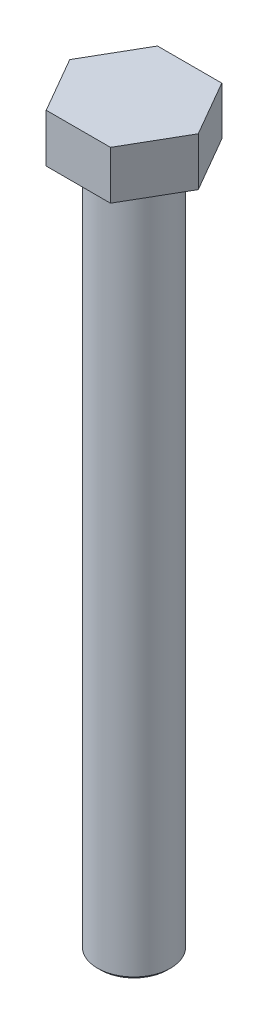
ISO-10303-21;
HEADER;
FILE_DESCRIPTION(('STEP AP214'),'2;1');
FILE_NAME('part.step','',(''),(''),'','','');
FILE_SCHEMA(('AUTOMOTIVE_DESIGN { 1 0 10303 214 1 1 1 1 }'));
ENDSEC;
DATA;
#1=APPLICATION_CONTEXT('core data for automotive mechanical design processes');
#2=APPLICATION_PROTOCOL_DEFINITION('international standard','automotive_design',2000,#1);
#3=PRODUCT_CONTEXT('',#1,'mechanical');
#4=PRODUCT('Part','Part','',(#3));
#5=PRODUCT_RELATED_PRODUCT_CATEGORY('part','',(#4));
#6=PRODUCT_DEFINITION_FORMATION('','',#4);
#7=PRODUCT_DEFINITION_CONTEXT('part definition',#1,'design');
#8=PRODUCT_DEFINITION('design','',#6,#7);
#9=PRODUCT_DEFINITION_SHAPE('','',#8);
#10=(LENGTH_UNIT() NAMED_UNIT(*) SI_UNIT(.MILLI.,.METRE.));
#11=(NAMED_UNIT(*) PLANE_ANGLE_UNIT() SI_UNIT($,.RADIAN.));
#12=(NAMED_UNIT(*) SI_UNIT($,.STERADIAN.) SOLID_ANGLE_UNIT());
#13=UNCERTAINTY_MEASURE_WITH_UNIT(LENGTH_MEASURE(1.E-05),#10,'distance_accuracy_value','');
#14=(GEOMETRIC_REPRESENTATION_CONTEXT(3) GLOBAL_UNCERTAINTY_ASSIGNED_CONTEXT((#13)) GLOBAL_UNIT_ASSIGNED_CONTEXT((#10,
#11,#12)) REPRESENTATION_CONTEXT('',''));
#15=CARTESIAN_POINT('',(0.,0.,0.));
#16=DIRECTION('',(0.,0.,1.));
#17=DIRECTION('',(1.,0.,0.));
#18=AXIS2_PLACEMENT_3D('',#15,#16,#17);
#19=CARTESIAN_POINT('',(8.2635566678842,-6.223,0.));
#20=DIRECTION('',(0.,1.,0.));
#21=DIRECTION('',(0.,0.,1.));
#22=AXIS2_PLACEMENT_3D('',#19,#20,#21);
#23=PLANE('',#22);
#24=DIRECTION('',(0.5,0.,-0.866025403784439));
#25=VECTOR('',#24,1.);
#26=CARTESIAN_POINT('',(4.1317783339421,-6.223,7.15645));
#27=LINE('',#26,#25);
#28=CARTESIAN_POINT('',(4.1317783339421,-6.223,7.15645));
#29=VERTEX_POINT('',#28);
#30=CARTESIAN_POINT('',(8.2635566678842,-6.223,0.));
#31=VERTEX_POINT('',#30);
#32=EDGE_CURVE('E135',#29,#31,#27,.T.);
#33=ORIENTED_EDGE('',*,*,#32,.F.);
#34=DIRECTION('',(1.,0.,0.));
#35=VECTOR('',#34,1.);
#36=CARTESIAN_POINT('',(-4.1317783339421,-6.223,7.15645));
#37=LINE('',#36,#35);
#38=CARTESIAN_POINT('',(-4.1317783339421,-6.223,7.15645));
#39=VERTEX_POINT('',#38);
#40=EDGE_CURVE('E110',#39,#29,#37,.T.);
#41=ORIENTED_EDGE('',*,*,#40,.F.);
#42=DIRECTION('',(0.5,0.,0.866025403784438));
#43=VECTOR('',#42,1.);
#44=CARTESIAN_POINT('',(-8.2635566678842,-6.223,0.));
#45=LINE('',#44,#43);
#46=CARTESIAN_POINT('',(-8.2635566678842,-6.223,0.));
#47=VERTEX_POINT('',#46);
#48=EDGE_CURVE('E95',#47,#39,#45,.T.);
#49=ORIENTED_EDGE('',*,*,#48,.F.);
#50=DIRECTION('',(-0.5,0.,0.866025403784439));
#51=VECTOR('',#50,1.);
#52=CARTESIAN_POINT('',(-4.1317783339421,-6.223,-7.15645));
#53=LINE('',#52,#51);
#54=CARTESIAN_POINT('',(-4.1317783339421,-6.223,-7.15645));
#55=VERTEX_POINT('',#54);
#56=EDGE_CURVE('E108',#55,#47,#53,.T.);
#57=ORIENTED_EDGE('',*,*,#56,.F.);
#58=DIRECTION('',(-1.,0.,0.));
#59=VECTOR('',#58,1.);
#60=CARTESIAN_POINT('',(4.1317783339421,-6.223,-7.15645));
#61=LINE('',#60,#59);
#62=CARTESIAN_POINT('',(4.1317783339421,-6.223,-7.15645));
#63=VERTEX_POINT('',#62);
#64=EDGE_CURVE('E113',#63,#55,#61,.T.);
#65=ORIENTED_EDGE('',*,*,#64,.F.);
#66=DIRECTION('',(-0.5,0.,-0.866025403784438));
#67=VECTOR('',#66,1.);
#68=CARTESIAN_POINT('',(8.2635566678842,-6.223,0.));
#69=LINE('',#68,#67);
#70=EDGE_CURVE('E115',#31,#63,#69,.T.);
#71=ORIENTED_EDGE('',*,*,#70,.F.);
#72=EDGE_LOOP('',(#33,#41,#49,#57,#65,#71));
#73=FACE_BOUND('',#72,.T.);
#74=CARTESIAN_POINT('',(0.,-6.22300000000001,0.));
#75=DIRECTION('',(0.,1.,0.));
#76=DIRECTION('',(0.,0.,1.));
#77=AXIS2_PLACEMENT_3D('',#74,#75,#76);
#78=CIRCLE('',#77,4.699);
#79=CARTESIAN_POINT('',(0.,-6.22300000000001,4.699));
#80=VERTEX_POINT('',#79);
#81=EDGE_CURVE('E137',#80,#80,#78,.F.);
#82=ORIENTED_EDGE('',*,*,#81,.F.);
#83=EDGE_LOOP('',(#82));
#84=FACE_BOUND('',#83,.T.);
#85=ADVANCED_FACE('F32',(#73,#84),#23,.F.);
#86=CARTESIAN_POINT('',(4.1317783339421,-6.223,7.15645));
#87=DIRECTION('',(0.866025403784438,0.,0.5));
#88=DIRECTION('',(0.5,0.,-0.866025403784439));
#89=AXIS2_PLACEMENT_3D('',#86,#87,#88);
#90=PLANE('',#89);
#91=DIRECTION('',(0.5,0.,-0.866025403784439));
#92=VECTOR('',#91,1.);
#93=CARTESIAN_POINT('',(4.1317783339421,0.,7.15645));
#94=LINE('',#93,#92);
#95=CARTESIAN_POINT('',(4.1317783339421,0.,7.15645));
#96=VERTEX_POINT('',#95);
#97=CARTESIAN_POINT('',(8.2635566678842,0.,0.));
#98=VERTEX_POINT('',#97);
#99=EDGE_CURVE('E120',#96,#98,#94,.T.);
#100=ORIENTED_EDGE('',*,*,#99,.F.);
#101=DIRECTION('',(0.,1.,0.));
#102=VECTOR('',#101,1.);
#103=CARTESIAN_POINT('',(4.1317783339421,-6.223,7.15645));
#104=LINE('',#103,#102);
#105=EDGE_CURVE('E49',#29,#96,#104,.T.);
#106=ORIENTED_EDGE('',*,*,#105,.F.);
#107=ORIENTED_EDGE('',*,*,#32,.T.);
#108=DIRECTION('',(0.,1.,0.));
#109=VECTOR('',#108,1.);
#110=CARTESIAN_POINT('',(8.2635566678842,-6.223,0.));
#111=LINE('',#110,#109);
#112=EDGE_CURVE('E84',#31,#98,#111,.T.);
#113=ORIENTED_EDGE('',*,*,#112,.T.);
#114=EDGE_LOOP('',(#100,#106,#107,#113));
#115=FACE_BOUND('',#114,.T.);
#116=ADVANCED_FACE('F158',(#115),#90,.T.);
#117=CARTESIAN_POINT('',(-4.1317783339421,-6.223,7.15645));
#118=DIRECTION('',(0.,0.,1.));
#119=DIRECTION('',(1.,0.,0.));
#120=AXIS2_PLACEMENT_3D('',#117,#118,#119);
#121=PLANE('',#120);
#122=DIRECTION('',(1.,0.,0.));
#123=VECTOR('',#122,1.);
#124=CARTESIAN_POINT('',(-4.1317783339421,0.,7.15645));
#125=LINE('',#124,#123);
#126=CARTESIAN_POINT('',(-4.1317783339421,0.,7.15645));
#127=VERTEX_POINT('',#126);
#128=EDGE_CURVE('E132',#127,#96,#125,.T.);
#129=ORIENTED_EDGE('',*,*,#128,.F.);
#130=DIRECTION('',(0.,1.,0.));
#131=VECTOR('',#130,1.);
#132=CARTESIAN_POINT('',(-4.1317783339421,-6.223,7.15645));
#133=LINE('',#132,#131);
#134=EDGE_CURVE('E72',#39,#127,#133,.T.);
#135=ORIENTED_EDGE('',*,*,#134,.F.);
#136=ORIENTED_EDGE('',*,*,#40,.T.);
#137=ORIENTED_EDGE('',*,*,#105,.T.);
#138=EDGE_LOOP('',(#129,#135,#136,#137));
#139=FACE_BOUND('',#138,.T.);
#140=ADVANCED_FACE('F163',(#139),#121,.T.);
#141=CARTESIAN_POINT('',(-8.2635566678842,-6.223,0.));
#142=DIRECTION('',(-0.866025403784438,0.,0.5));
#143=DIRECTION('',(0.5,0.,0.866025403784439));
#144=AXIS2_PLACEMENT_3D('',#141,#142,#143);
#145=PLANE('',#144);
#146=DIRECTION('',(0.5,0.,0.866025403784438));
#147=VECTOR('',#146,1.);
#148=CARTESIAN_POINT('',(-8.2635566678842,0.,0.));
#149=LINE('',#148,#147);
#150=CARTESIAN_POINT('',(-8.2635566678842,0.,0.));
#151=VERTEX_POINT('',#150);
#152=EDGE_CURVE('E97',#151,#127,#149,.T.);
#153=ORIENTED_EDGE('',*,*,#152,.F.);
#154=DIRECTION('',(0.,1.,0.));
#155=VECTOR('',#154,1.);
#156=CARTESIAN_POINT('',(-8.2635566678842,-6.223,0.));
#157=LINE('',#156,#155);
#158=EDGE_CURVE('E92',#47,#151,#157,.T.);
#159=ORIENTED_EDGE('',*,*,#158,.F.);
#160=ORIENTED_EDGE('',*,*,#48,.T.);
#161=ORIENTED_EDGE('',*,*,#134,.T.);
#162=EDGE_LOOP('',(#153,#159,#160,#161));
#163=FACE_BOUND('',#162,.T.);
#164=ADVANCED_FACE('F94',(#163),#145,.T.);
#165=CARTESIAN_POINT('',(-4.1317783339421,-6.223,-7.15645));
#166=DIRECTION('',(-0.866025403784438,0.,-0.5));
#167=DIRECTION('',(-0.5,0.,0.866025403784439));
#168=AXIS2_PLACEMENT_3D('',#165,#166,#167);
#169=PLANE('',#168);
#170=DIRECTION('',(-0.5,0.,0.866025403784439));
#171=VECTOR('',#170,1.);
#172=CARTESIAN_POINT('',(-4.1317783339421,0.,-7.15645));
#173=LINE('',#172,#171);
#174=CARTESIAN_POINT('',(-4.1317783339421,0.,-7.15645));
#175=VERTEX_POINT('',#174);
#176=EDGE_CURVE('E129',#175,#151,#173,.T.);
#177=ORIENTED_EDGE('',*,*,#176,.F.);
#178=DIRECTION('',(0.,1.,0.));
#179=VECTOR('',#178,1.);
#180=CARTESIAN_POINT('',(-4.1317783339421,-6.223,-7.15645));
#181=LINE('',#180,#179);
#182=EDGE_CURVE('E102',#55,#175,#181,.T.);
#183=ORIENTED_EDGE('',*,*,#182,.F.);
#184=ORIENTED_EDGE('',*,*,#56,.T.);
#185=ORIENTED_EDGE('',*,*,#158,.T.);
#186=EDGE_LOOP('',(#177,#183,#184,#185));
#187=FACE_BOUND('',#186,.T.);
#188=ADVANCED_FACE('F112',(#187),#169,.T.);
#189=CARTESIAN_POINT('',(4.1317783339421,-6.223,-7.15645));
#190=DIRECTION('',(0.,0.,-1.));
#191=DIRECTION('',(-1.,0.,0.));
#192=AXIS2_PLACEMENT_3D('',#189,#190,#191);
#193=PLANE('',#192);
#194=DIRECTION('',(-1.,0.,0.));
#195=VECTOR('',#194,1.);
#196=CARTESIAN_POINT('',(4.1317783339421,0.,-7.15645));
#197=LINE('',#196,#195);
#198=CARTESIAN_POINT('',(4.1317783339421,0.,-7.15645));
#199=VERTEX_POINT('',#198);
#200=EDGE_CURVE('E126',#199,#175,#197,.T.);
#201=ORIENTED_EDGE('',*,*,#200,.F.);
#202=DIRECTION('',(0.,1.,0.));
#203=VECTOR('',#202,1.);
#204=CARTESIAN_POINT('',(4.1317783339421,-6.223,-7.15645));
#205=LINE('',#204,#203);
#206=EDGE_CURVE('E140',#63,#199,#205,.T.);
#207=ORIENTED_EDGE('',*,*,#206,.F.);
#208=ORIENTED_EDGE('',*,*,#64,.T.);
#209=ORIENTED_EDGE('',*,*,#182,.T.);
#210=EDGE_LOOP('',(#201,#207,#208,#209));
#211=FACE_BOUND('',#210,.T.);
#212=ADVANCED_FACE('F177',(#211),#193,.T.);
#213=CARTESIAN_POINT('',(8.2635566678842,-6.223,0.));
#214=DIRECTION('',(0.866025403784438,0.,-0.5));
#215=DIRECTION('',(-0.5,0.,-0.866025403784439));
#216=AXIS2_PLACEMENT_3D('',#213,#214,#215);
#217=PLANE('',#216);
#218=DIRECTION('',(-0.5,0.,-0.866025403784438));
#219=VECTOR('',#218,1.);
#220=CARTESIAN_POINT('',(8.2635566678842,0.,0.));
#221=LINE('',#220,#219);
#222=EDGE_CURVE('E123',#98,#199,#221,.T.);
#223=ORIENTED_EDGE('',*,*,#222,.F.);
#224=ORIENTED_EDGE('',*,*,#112,.F.);
#225=ORIENTED_EDGE('',*,*,#70,.T.);
#226=ORIENTED_EDGE('',*,*,#206,.T.);
#227=EDGE_LOOP('',(#223,#224,#225,#226));
#228=FACE_BOUND('',#227,.T.);
#229=ADVANCED_FACE('F169',(#228),#217,.T.);
#230=CARTESIAN_POINT('',(8.2635566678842,0.,0.));
#231=DIRECTION('',(0.,1.,0.));
#232=DIRECTION('',(0.,0.,1.));
#233=AXIS2_PLACEMENT_3D('',#230,#231,#232);
#234=PLANE('',#233);
#235=ORIENTED_EDGE('',*,*,#99,.T.);
#236=ORIENTED_EDGE('',*,*,#222,.T.);
#237=ORIENTED_EDGE('',*,*,#200,.T.);
#238=ORIENTED_EDGE('',*,*,#176,.T.);
#239=ORIENTED_EDGE('',*,*,#152,.T.);
#240=ORIENTED_EDGE('',*,*,#128,.T.);
#241=EDGE_LOOP('',(#235,#236,#237,#238,#239,#240));
#242=FACE_BOUND('',#241,.T.);
#243=ADVANCED_FACE('F166',(#242),#234,.T.);
#244=CARTESIAN_POINT('',(0.,-95.123,0.));
#245=DIRECTION('',(0.,1.,0.));
#246=DIRECTION('',(0.,0.,1.));
#247=AXIS2_PLACEMENT_3D('',#244,#245,#246);
#248=CYLINDRICAL_SURFACE('',#247,4.699);
#249=CARTESIAN_POINT('',(0.,-94.7268,0.));
#250=DIRECTION('',(0.,-1.,0.));
#251=DIRECTION('',(0.,0.,-1.));
#252=AXIS2_PLACEMENT_3D('',#249,#250,#251);
#253=CIRCLE('',#252,4.699);
#254=CARTESIAN_POINT('',(0.,-94.7268,-4.699));
#255=VERTEX_POINT('',#254);
#256=EDGE_CURVE('E11',#255,#255,#253,.F.);
#257=ORIENTED_EDGE('',*,*,#256,.T.);
#258=EDGE_LOOP('',(#257));
#259=FACE_BOUND('',#258,.T.);
#260=ORIENTED_EDGE('',*,*,#81,.T.);
#261=EDGE_LOOP('',(#260));
#262=FACE_BOUND('',#261,.T.);
#263=ADVANCED_FACE('F154',(#259,#262),#248,.T.);
#264=CARTESIAN_POINT('',(0.,-95.123,0.));
#265=DIRECTION('',(0.,-1.,0.));
#266=DIRECTION('',(0.,0.,-1.));
#267=AXIS2_PLACEMENT_3D('',#264,#265,#266);
#268=PLANE('',#267);
#269=CARTESIAN_POINT('',(0.,-95.123,0.));
#270=DIRECTION('',(0.,-1.,0.));
#271=DIRECTION('',(0.,0.,-1.));
#272=AXIS2_PLACEMENT_3D('',#269,#270,#271);
#273=CIRCLE('',#272,4.3028);
#274=CARTESIAN_POINT('',(0.,-95.123,-4.3028));
#275=VERTEX_POINT('',#274);
#276=EDGE_CURVE('E41',#275,#275,#273,.T.);
#277=ORIENTED_EDGE('',*,*,#276,.T.);
#278=EDGE_LOOP('',(#277));
#279=FACE_BOUND('',#278,.T.);
#280=ADVANCED_FACE('F147',(#279),#268,.T.);
#281=CARTESIAN_POINT('',(0.,-95.123,0.));
#282=DIRECTION('',(0.,1.,0.));
#283=DIRECTION('',(0.,0.,1.));
#284=AXIS2_PLACEMENT_3D('',#281,#282,#283);
#285=CONICAL_SURFACE('',#284,4.3028,0.785398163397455);
#286=ORIENTED_EDGE('',*,*,#256,.F.);
#287=EDGE_LOOP('',(#286));
#288=FACE_BOUND('',#287,.T.);
#289=ORIENTED_EDGE('',*,*,#276,.F.);
#290=EDGE_LOOP('',(#289));
#291=FACE_BOUND('',#290,.T.);
#292=ADVANCED_FACE('F34',(#288,#291),#285,.T.);
#293=CLOSED_SHELL('',(#85,#116,#140,#164,#188,#212,#229,#243,#263,#280,#292));
#294=MANIFOLD_SOLID_BREP('B2',#293);
#295=ADVANCED_BREP_SHAPE_REPRESENTATION('',(#18,#294),#14);
#296=SHAPE_DEFINITION_REPRESENTATION(#9,#295);
ENDSEC;
END-ISO-10303-21;
